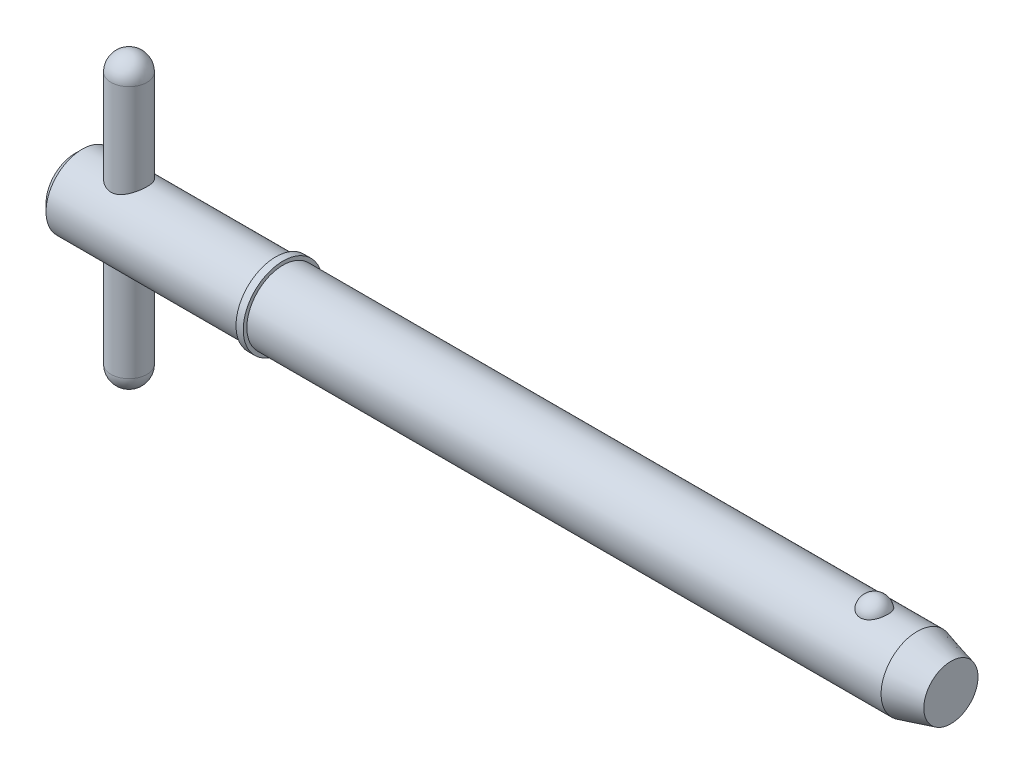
ISO-10303-21;
HEADER;
FILE_DESCRIPTION(('STEP AP214'),'2;1');
FILE_NAME('part.step','',(''),(''),'','','');
FILE_SCHEMA(('AUTOMOTIVE_DESIGN { 1 0 10303 214 1 1 1 1 }'));
ENDSEC;
DATA;
#1=APPLICATION_CONTEXT('core data for automotive mechanical design processes');
#2=APPLICATION_PROTOCOL_DEFINITION('international standard','automotive_design',2000,#1);
#3=PRODUCT_CONTEXT('',#1,'mechanical');
#4=PRODUCT('Part','Part','',(#3));
#5=PRODUCT_RELATED_PRODUCT_CATEGORY('part','',(#4));
#6=PRODUCT_DEFINITION_FORMATION('','',#4);
#7=PRODUCT_DEFINITION_CONTEXT('part definition',#1,'design');
#8=PRODUCT_DEFINITION('design','',#6,#7);
#9=PRODUCT_DEFINITION_SHAPE('','',#8);
#10=(LENGTH_UNIT() NAMED_UNIT(*) SI_UNIT(.MILLI.,.METRE.));
#11=(NAMED_UNIT(*) PLANE_ANGLE_UNIT() SI_UNIT($,.RADIAN.));
#12=(NAMED_UNIT(*) SI_UNIT($,.STERADIAN.) SOLID_ANGLE_UNIT());
#13=UNCERTAINTY_MEASURE_WITH_UNIT(LENGTH_MEASURE(1.E-05),#10,'distance_accuracy_value','');
#14=(GEOMETRIC_REPRESENTATION_CONTEXT(3) GLOBAL_UNCERTAINTY_ASSIGNED_CONTEXT((#13)) GLOBAL_UNIT_ASSIGNED_CONTEXT((#10,
#11,#12)) REPRESENTATION_CONTEXT('',''));
#15=CARTESIAN_POINT('',(0.,0.,0.));
#16=DIRECTION('',(0.,0.,1.));
#17=DIRECTION('',(1.,0.,0.));
#18=AXIS2_PLACEMENT_3D('',#15,#16,#17);
#19=CARTESIAN_POINT('',(4.755,12.7,0.));
#20=DIRECTION('',(0.,-1.,0.));
#21=DIRECTION('',(0.,0.,-1.));
#22=AXIS2_PLACEMENT_3D('',#19,#20,#21);
#23=CYLINDRICAL_SURFACE('',#22,1.585);
#24=CARTESIAN_POINT('',(4.755,-11.115,0.));
#25=DIRECTION('',(0.,-1.,0.));
#26=DIRECTION('',(0.,0.,-1.));
#27=AXIS2_PLACEMENT_3D('',#24,#25,#26);
#28=CIRCLE('',#27,1.585);
#29=CARTESIAN_POINT('',(4.755,-11.115,-1.585));
#30=VERTEX_POINT('',#29);
#31=EDGE_CURVE('P0_E10',#30,#30,#28,.F.);
#32=ORIENTED_EDGE('',*,*,#31,.T.);
#33=EDGE_LOOP('',(#32));
#34=FACE_BOUND('',#33,.T.);
#35=CARTESIAN_POINT('',(4.755,11.115,0.));
#36=DIRECTION('',(0.,-1.,0.));
#37=DIRECTION('',(0.,0.,-1.));
#38=AXIS2_PLACEMENT_3D('',#35,#36,#37);
#39=CIRCLE('',#38,1.585);
#40=CARTESIAN_POINT('',(4.755,11.115,-1.585));
#41=VERTEX_POINT('',#40);
#42=EDGE_CURVE('P0_E21',#41,#41,#39,.T.);
#43=ORIENTED_EDGE('',*,*,#42,.T.);
#44=EDGE_LOOP('',(#43));
#45=FACE_BOUND('',#44,.T.);
#46=ADVANCED_FACE('P0_F14',(#34,#45),#23,.T.);
#47=CARTESIAN_POINT('',(4.755,-11.115,0.));
#48=DIRECTION('',(0.,0.,1.));
#49=DIRECTION('',(1.,0.,0.));
#50=AXIS2_PLACEMENT_3D('',#47,#48,#49);
#51=SPHERICAL_SURFACE('',#50,1.585);
#52=CARTESIAN_POINT('',(4.755,-11.115,0.));
#53=DIRECTION('',(0.,-1.,0.));
#54=DIRECTION('',(0.,0.,-1.));
#55=AXIS2_PLACEMENT_3D('',#52,#53,#54);
#56=SPHERICAL_SURFACE('',#55,1.585);
#57=ORIENTED_EDGE('',*,*,#31,.F.);
#58=EDGE_LOOP('',(#57));
#59=FACE_BOUND('',#58,.T.);
#60=ADVANCED_FACE('P0_F29',(#59),#56,.T.);
#61=CARTESIAN_POINT('',(4.755,11.115,0.));
#62=DIRECTION('',(0.,0.,1.));
#63=DIRECTION('',(1.,0.,0.));
#64=AXIS2_PLACEMENT_3D('',#61,#62,#63);
#65=SPHERICAL_SURFACE('',#64,1.585);
#66=CARTESIAN_POINT('',(4.755,11.115,0.));
#67=DIRECTION('',(0.,-1.,0.));
#68=DIRECTION('',(0.,0.,-1.));
#69=AXIS2_PLACEMENT_3D('',#66,#67,#68);
#70=SPHERICAL_SURFACE('',#69,1.585);
#71=ORIENTED_EDGE('',*,*,#42,.F.);
#72=EDGE_LOOP('',(#71));
#73=FACE_BOUND('',#72,.T.);
#74=ADVANCED_FACE('P0_F16',(#73),#70,.T.);
#75=CLOSED_SHELL('',(#46,#60,#74));
#76=MANIFOLD_SOLID_BREP('P0_B1',#75);
#77=CARTESIAN_POINT('',(0.,0.,0.));
#78=DIRECTION('',(1.,0.,0.));
#79=DIRECTION('',(0.,0.,-1.));
#80=AXIS2_PLACEMENT_3D('',#77,#78,#79);
#81=CYLINDRICAL_SURFACE('',#80,3.175);
#82=CARTESIAN_POINT('',(74.0476846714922,0.,0.));
#83=DIRECTION('',(1.,0.,0.));
#84=DIRECTION('',(0.,0.,-1.));
#85=AXIS2_PLACEMENT_3D('',#82,#83,#84);
#86=CIRCLE('',#85,3.175);
#87=CARTESIAN_POINT('',(74.0476846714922,0.,-3.175));
#88=VERTEX_POINT('',#87);
#89=EDGE_CURVE('P1_E81',#88,#88,#86,.T.);
#90=ORIENTED_EDGE('',*,*,#89,.F.);
#91=EDGE_LOOP('',(#90));
#92=FACE_BOUND('',#91,.T.);
#93=CARTESIAN_POINT('',(18.29,0.,0.));
#94=DIRECTION('',(1.,0.,0.));
#95=DIRECTION('',(0.,0.,-1.));
#96=AXIS2_PLACEMENT_3D('',#93,#94,#95);
#97=CIRCLE('',#96,3.175);
#98=CARTESIAN_POINT('',(18.29,0.,-3.175));
#99=VERTEX_POINT('',#98);
#100=EDGE_CURVE('P1_E85',#99,#99,#97,.T.);
#101=ORIENTED_EDGE('',*,*,#100,.T.);
#102=EDGE_LOOP('',(#101));
#103=FACE_BOUND('',#102,.T.);
#104=CARTESIAN_POINT('',(70.2757276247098,2.92898950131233,1.2254164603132));
#105=CARTESIAN_POINT('',(70.212316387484,2.92899434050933,1.22541146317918));
#106=CARTESIAN_POINT('',(70.1487979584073,2.93112688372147,1.2203464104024));
#107=CARTESIAN_POINT('',(70.0235306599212,2.93942752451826,1.20020949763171));
#108=CARTESIAN_POINT('',(69.9617869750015,2.9456063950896,1.1851109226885));
#109=CARTESIAN_POINT('',(69.8420651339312,2.96127115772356,1.14540352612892));
#110=CARTESIAN_POINT('',(69.7840775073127,2.97074831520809,1.12081980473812));
#111=CARTESIAN_POINT('',(69.6731943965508,2.99197584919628,1.06285154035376));
#112=CARTESIAN_POINT('',(69.6202966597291,3.0037252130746,1.02947091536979));
#113=CARTESIAN_POINT('',(69.5192688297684,3.02865714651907,0.953674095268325));
#114=CARTESIAN_POINT('',(69.471324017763,3.04187163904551,0.911021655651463));
#115=CARTESIAN_POINT('',(69.3830360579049,3.06808741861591,0.818400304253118));
#116=CARTESIAN_POINT('',(69.3426952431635,3.08108863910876,0.768429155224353));
#117=CARTESIAN_POINT('',(69.2688039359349,3.10614903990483,0.660064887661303));
#118=CARTESIAN_POINT('',(69.2356330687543,3.11814104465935,0.601396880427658));
#119=CARTESIAN_POINT('',(69.1791190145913,3.13926931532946,0.479026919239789));
#120=CARTESIAN_POINT('',(69.1557764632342,3.14840539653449,0.415324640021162));
#121=CARTESIAN_POINT('',(69.1191785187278,3.16298160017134,0.283885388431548));
#122=CARTESIAN_POINT('',(69.1060407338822,3.16837855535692,0.216110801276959));
#123=CARTESIAN_POINT('',(69.0905676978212,3.17475386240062,0.0791367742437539));
#124=CARTESIAN_POINT('',(69.088232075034,3.17573236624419,0.00993738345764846));
#125=CARTESIAN_POINT('',(69.094388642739,3.17318075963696,-0.127420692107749));
#126=CARTESIAN_POINT('',(69.1028073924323,3.16968122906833,-0.19558325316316));
#127=CARTESIAN_POINT('',(69.1301752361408,3.1585790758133,-0.329413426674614));
#128=CARTESIAN_POINT('',(69.1491245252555,3.15097637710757,-0.395080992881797));
#129=CARTESIAN_POINT('',(69.1972057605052,3.13242485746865,-0.5221806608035));
#130=CARTESIAN_POINT('',(69.2263524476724,3.12147119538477,-0.583606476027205));
#131=CARTESIAN_POINT('',(69.2942352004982,3.09734973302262,-0.700436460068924));
#132=CARTESIAN_POINT('',(69.332972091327,3.08418174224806,-0.755840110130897));
#133=CARTESIAN_POINT('',(69.4194771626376,3.05694884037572,-0.859404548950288));
#134=CARTESIAN_POINT('',(69.4672961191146,3.04287919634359,-0.907521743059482));
#135=CARTESIAN_POINT('',(69.5707353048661,3.01548927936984,-0.994758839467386));
#136=CARTESIAN_POINT('',(69.6263549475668,3.0021689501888,-1.03387941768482));
#137=CARTESIAN_POINT('',(69.7428093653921,2.97810316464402,-1.10126594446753));
#138=CARTESIAN_POINT('',(69.8035182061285,2.96731170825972,-1.12973256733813));
#139=CARTESIAN_POINT('',(69.9293712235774,2.94928934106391,-1.17598467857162));
#140=CARTESIAN_POINT('',(69.9945137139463,2.94205708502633,-1.19377420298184));
#141=CARTESIAN_POINT('',(70.1238562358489,2.93233065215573,-1.21746387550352));
#142=CARTESIAN_POINT('',(70.1879385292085,2.92961621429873,-1.22391763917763));
#143=CARTESIAN_POINT('',(70.3163375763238,2.92855752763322,-1.22644976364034));
#144=CARTESIAN_POINT('',(70.3806542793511,2.93021238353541,-1.22253024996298));
#145=CARTESIAN_POINT('',(70.5055239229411,2.9375685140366,-1.20474140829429));
#146=CARTESIAN_POINT('',(70.566131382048,2.94313790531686,-1.19119621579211));
#147=CARTESIAN_POINT('',(70.6841106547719,2.95756226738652,-1.15491492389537));
#148=CARTESIAN_POINT('',(70.7414822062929,2.96641750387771,-1.13217808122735));
#149=CARTESIAN_POINT('',(70.8527699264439,2.98669918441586,-1.07755083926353));
#150=CARTESIAN_POINT('',(70.9065845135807,2.9981771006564,-1.04547308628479));
#151=CARTESIAN_POINT('',(71.0081473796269,3.02240235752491,-0.973220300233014));
#152=CARTESIAN_POINT('',(71.0558942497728,3.03514999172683,-0.933043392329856));
#153=CARTESIAN_POINT('',(71.1465817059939,3.06131230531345,-0.843372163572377));
#154=CARTESIAN_POINT('',(71.1891588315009,3.07472822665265,-0.793510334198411));
#155=CARTESIAN_POINT('',(71.2656765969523,3.10021106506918,-0.687241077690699));
#156=CARTESIAN_POINT('',(71.2996156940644,3.1122777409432,-0.630832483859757));
#157=CARTESIAN_POINT('',(71.3591209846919,3.134208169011,-0.51105938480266));
#158=CARTESIAN_POINT('',(71.3843892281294,3.14399040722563,-0.447531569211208));
#159=CARTESIAN_POINT('',(71.4245117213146,3.15983820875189,-0.31682749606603));
#160=CARTESIAN_POINT('',(71.4393659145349,3.16590375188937,-0.249651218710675));
#161=CARTESIAN_POINT('',(71.458358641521,3.17370076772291,-0.113549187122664));
#162=CARTESIAN_POINT('',(71.4624966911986,3.17543204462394,-0.0446233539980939));
#163=CARTESIAN_POINT('',(71.4599697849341,3.17438372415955,0.0929938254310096));
#164=CARTESIAN_POINT('',(71.4533050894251,3.17160423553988,0.16168517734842));
#165=CARTESIAN_POINT('',(71.4293754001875,3.1618438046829,0.296502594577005));
#166=CARTESIAN_POINT('',(71.4121674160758,3.15488546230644,0.362640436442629));
#167=CARTESIAN_POINT('',(71.367547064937,3.13748892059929,0.490896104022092));
#168=CARTESIAN_POINT('',(71.3401339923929,3.12705048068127,0.553013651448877));
#169=CARTESIAN_POINT('',(71.2754626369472,3.10369139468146,0.671876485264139));
#170=CARTESIAN_POINT('',(71.2381467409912,3.0907563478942,0.72858760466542));
#171=CARTESIAN_POINT('',(71.1545246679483,3.06381731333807,0.834653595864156));
#172=CARTESIAN_POINT('',(71.1082189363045,3.04981337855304,0.884008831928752));
#173=CARTESIAN_POINT('',(71.007718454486,3.02230423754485,0.973916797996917));
#174=CARTESIAN_POINT('',(70.953535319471,3.00879833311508,1.01448227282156));
#175=CARTESIAN_POINT('',(70.8385299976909,2.98383625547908,1.0857155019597));
#176=CARTESIAN_POINT('',(70.7777053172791,2.9723808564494,1.11637952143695));
#177=CARTESIAN_POINT('',(70.6533690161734,2.95329063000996,1.16592590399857));
#178=CARTESIAN_POINT('',(70.5900230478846,2.9455373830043,1.18517901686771));
#179=CARTESIAN_POINT('',(70.4607664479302,2.9342556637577,1.21284802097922));
#180=CARTESIAN_POINT('',(70.3948641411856,2.93071450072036,1.2212964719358));
#181=CARTESIAN_POINT('',(70.311116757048,2.9291525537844,1.22502505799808));
#182=CARTESIAN_POINT('',(70.2934263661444,2.92898815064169,1.22541785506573));
#183=CARTESIAN_POINT('',(70.2757276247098,2.92898950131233,1.2254164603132));
#184=B_SPLINE_CURVE_WITH_KNOTS('',3,(#104,#105,#106,#107,#108,#109,#110,#111,#112,#113,#114,
#115,#116,#117,#118,#119,#120,#121,#122,#123,#124,#125,#126,#127,#128,#129,#130,#131,#132,#133,
#134,#135,#136,#137,#138,#139,#140,#141,#142,#143,#144,#145,#146,#147,#148,#149,#150,#151,#152,
#153,#154,#155,#156,#157,#158,#159,#160,#161,#162,#163,#164,#165,#166,#167,#168,#169,#170,#171,
#172,#173,#174,#175,#176,#177,#178,#179,#180,#181,#182,#183),.UNSPECIFIED.,.T.,.F.,(4,2,2,2,2,2,
2,2,2,2,2,2,2,2,2,2,2,2,2,2,2,2,2,2,2,2,2,2,2,2,2,2,2,2,2,2,2,2,2,4),(0.,0.190186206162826,
0.380880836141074,0.571074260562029,0.761183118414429,0.956866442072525,1.15260970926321,
1.3570177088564,1.56143892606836,1.76818248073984,1.97491892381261,2.18025109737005,
2.38558707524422,2.59122111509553,2.79687285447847,3.00371012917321,3.2105318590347,
3.41323429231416,3.61586005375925,3.80828192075,4.00066436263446,4.18685798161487,
4.37306665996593,4.56330302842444,4.75358348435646,4.95345287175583,5.15335793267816,
5.35957003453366,5.56578325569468,5.7720057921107,5.97822335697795,6.18333558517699,
6.38846199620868,6.59480900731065,6.80114579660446,7.00718137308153,7.21329457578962,
7.41228022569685,7.61066481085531,7.66374777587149),.UNSPECIFIED.);
#185=CARTESIAN_POINT('',(70.2757276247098,2.92898950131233,1.2254164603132));
#186=VERTEX_POINT('',#185);
#187=EDGE_CURVE('P1_E35',#186,#186,#184,.T.);
#188=ORIENTED_EDGE('',*,*,#187,.T.);
#189=EDGE_LOOP('',(#188));
#190=FACE_BOUND('',#189,.T.);
#191=ADVANCED_FACE('P1_F13',(#92,#103,#190),#81,.T.);
#192=CARTESIAN_POINT('',(0.,0.,0.));
#193=DIRECTION('',(-1.,0.,0.));
#194=DIRECTION('',(0.,0.,1.));
#195=AXIS2_PLACEMENT_3D('',#192,#193,#194);
#196=PLANE('',#195);
#197=CARTESIAN_POINT('',(0.,0.,0.));
#198=DIRECTION('',(1.,0.,0.));
#199=DIRECTION('',(0.,0.,-1.));
#200=AXIS2_PLACEMENT_3D('',#197,#198,#199);
#201=CIRCLE('',#200,2.54);
#202=CARTESIAN_POINT('',(0.,0.,-2.54));
#203=VERTEX_POINT('',#202);
#204=EDGE_CURVE('P1_E9',#203,#203,#201,.T.);
#205=ORIENTED_EDGE('',*,*,#204,.F.);
#206=EDGE_LOOP('',(#205));
#207=FACE_BOUND('',#206,.T.);
#208=ADVANCED_FACE('P1_F15',(#207),#196,.T.);
#209=CARTESIAN_POINT('',(0.634999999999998,0.,0.));
#210=DIRECTION('',(1.,0.,0.));
#211=DIRECTION('',(0.,0.,-1.));
#212=AXIS2_PLACEMENT_3D('',#209,#210,#211);
#213=CONICAL_SURFACE('',#212,3.175,0.78539816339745);
#214=ORIENTED_EDGE('',*,*,#204,.T.);
#215=EDGE_LOOP('',(#214));
#216=FACE_BOUND('',#215,.T.);
#217=CARTESIAN_POINT('',(0.634999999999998,0.,0.));
#218=DIRECTION('',(1.,0.,0.));
#219=DIRECTION('',(0.,0.,-1.));
#220=AXIS2_PLACEMENT_3D('',#217,#218,#219);
#221=CIRCLE('',#220,3.175);
#222=CARTESIAN_POINT('',(0.634999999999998,0.,-3.175));
#223=VERTEX_POINT('',#222);
#224=EDGE_CURVE('P1_E26',#223,#223,#221,.T.);
#225=ORIENTED_EDGE('',*,*,#224,.F.);
#226=EDGE_LOOP('',(#225));
#227=FACE_BOUND('',#226,.T.);
#228=ADVANCED_FACE('P1_F77',(#216,#227),#213,.T.);
#229=CARTESIAN_POINT('',(0.,0.,0.));
#230=DIRECTION('',(1.,0.,0.));
#231=DIRECTION('',(0.,0.,-1.));
#232=AXIS2_PLACEMENT_3D('',#229,#230,#231);
#233=CYLINDRICAL_SURFACE('',#232,3.175);
#234=CARTESIAN_POINT('',(4.755,-2.75107251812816,1.585));
#235=CARTESIAN_POINT('',(4.67238891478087,-2.7510796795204,1.58499425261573));
#236=CARTESIAN_POINT('',(4.58967306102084,-2.75485010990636,1.57849830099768));
#237=CARTESIAN_POINT('',(4.42677850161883,-2.76938647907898,1.55284486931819));
#238=CARTESIAN_POINT('',(4.34660551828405,-2.78016716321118,1.53366069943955));
#239=CARTESIAN_POINT('',(4.19146029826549,-2.80716278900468,1.48366329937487));
#240=CARTESIAN_POINT('',(4.11646293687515,-2.8233488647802,1.45291173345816));
#241=CARTESIAN_POINT('',(3.97271079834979,-2.85928672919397,1.38084067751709));
#242=CARTESIAN_POINT('',(3.90395634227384,-2.87903870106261,1.33952064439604));
#243=CARTESIAN_POINT('',(3.76839976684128,-2.921867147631,1.24350234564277));
#244=CARTESIAN_POINT('',(3.702222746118,-2.94508343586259,1.18798355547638));
#245=CARTESIAN_POINT('',(3.5796334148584,-2.99109588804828,1.06685014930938));
#246=CARTESIAN_POINT('',(3.52322596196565,-3.01389183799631,1.00123054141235));
#247=CARTESIAN_POINT('',(3.41807024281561,-3.05832598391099,0.856373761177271));
#248=CARTESIAN_POINT('',(3.37009053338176,-3.07978367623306,0.776518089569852));
#249=CARTESIAN_POINT('',(3.28853137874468,-3.11730894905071,0.608596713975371));
#250=CARTESIAN_POINT('',(3.25494287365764,-3.1333799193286,0.520536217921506));
#251=CARTESIAN_POINT('',(3.20559401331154,-3.15731341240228,0.345327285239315));
#252=CARTESIAN_POINT('',(3.18873760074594,-3.16567752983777,0.258557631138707));
#253=CARTESIAN_POINT('',(3.16972238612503,-3.17512718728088,0.0830496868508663));
#254=CARTESIAN_POINT('',(3.16755472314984,-3.17621711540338,-0.00568738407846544));
#255=CARTESIAN_POINT('',(3.1775542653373,-3.17123385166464,-0.174372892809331));
#256=CARTESIAN_POINT('',(3.18849502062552,-3.16577346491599,-0.254416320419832));
#257=CARTESIAN_POINT('',(3.22220680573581,-3.14922844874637,-0.411354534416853));
#258=CARTESIAN_POINT('',(3.2449787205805,-3.13814339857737,-0.488249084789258));
#259=CARTESIAN_POINT('',(3.30185558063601,-3.111172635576,-0.638050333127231));
#260=CARTESIAN_POINT('',(3.33611332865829,-3.09522247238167,-0.710886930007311));
#261=CARTESIAN_POINT('',(3.41477890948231,-3.05996035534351,-0.849953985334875));
#262=CARTESIAN_POINT('',(3.45919037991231,-3.04064719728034,-0.916182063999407));
#263=CARTESIAN_POINT('',(3.5617148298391,-2.99832415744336,-1.04681642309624));
#264=CARTESIAN_POINT('',(3.62072497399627,-2.97513741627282,-1.11046186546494));
#265=CARTESIAN_POINT('',(3.7483697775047,-2.92885066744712,-1.22736291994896));
#266=CARTESIAN_POINT('',(3.81701173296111,-2.90575073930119,-1.2806105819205));
#267=CARTESIAN_POINT('',(3.96727993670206,-2.86067370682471,-1.37849835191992));
#268=CARTESIAN_POINT('',(4.04945242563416,-2.83885964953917,-1.42238246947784));
#269=CARTESIAN_POINT('',(4.2213558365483,-2.80110454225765,-1.49537418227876));
#270=CARTESIAN_POINT('',(4.3110787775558,-2.78515738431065,-1.52449715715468));
#271=CARTESIAN_POINT('',(4.48806324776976,-2.76271292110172,-1.56478065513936));
#272=CARTESIAN_POINT('',(4.57495732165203,-2.75556745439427,-1.57718067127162));
#273=CARTESIAN_POINT('',(4.74985771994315,-2.74969306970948,-1.58740564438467));
#274=CARTESIAN_POINT('',(4.8378632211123,-2.75095824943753,-1.58524082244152));
#275=CARTESIAN_POINT('',(5.00227282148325,-2.76107477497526,-1.56753530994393));
#276=CARTESIAN_POINT('',(5.07889680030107,-2.76908515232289,-1.55347662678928));
#277=CARTESIAN_POINT('',(5.22855309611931,-2.79054849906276,-1.51458035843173));
#278=CARTESIAN_POINT('',(5.30158424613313,-2.80400322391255,-1.489739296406));
#279=CARTESIAN_POINT('',(5.44583114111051,-2.83556995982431,-1.42877335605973));
#280=CARTESIAN_POINT('',(5.51680600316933,-2.85386886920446,-1.39217900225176));
#281=CARTESIAN_POINT('',(5.6520174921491,-2.89289503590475,-1.30915485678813));
#282=CARTESIAN_POINT('',(5.71625063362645,-2.91362353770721,-1.26272001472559));
#283=CARTESIAN_POINT('',(5.8445938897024,-2.95830220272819,-1.15451693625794));
#284=CARTESIAN_POINT('',(5.90767560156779,-2.98233004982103,-1.09155543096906));
#285=CARTESIAN_POINT('',(6.0226995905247,-3.02864458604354,-0.955560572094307));
#286=CARTESIAN_POINT('',(6.07463814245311,-3.05093069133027,-0.882523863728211));
#287=CARTESIAN_POINT('',(6.16704288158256,-3.09200671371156,-0.725836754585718));
#288=CARTESIAN_POINT('',(6.20717458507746,-3.11069030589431,-0.64195924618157));
#289=CARTESIAN_POINT('',(6.27235859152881,-3.1416474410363,-0.467442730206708));
#290=CARTESIAN_POINT('',(6.29742409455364,-3.15392659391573,-0.376809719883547));
#291=CARTESIAN_POINT('',(6.32960989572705,-3.16979844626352,-0.200314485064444));
#292=CARTESIAN_POINT('',(6.33816324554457,-3.17408359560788,-0.114775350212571));
#293=CARTESIAN_POINT('',(6.34130309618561,-3.17565001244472,0.0566108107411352));
#294=CARTESIAN_POINT('',(6.33589445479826,-3.17293371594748,0.142457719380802));
#295=CARTESIAN_POINT('',(6.31221457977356,-3.16120608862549,0.306097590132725));
#296=CARTESIAN_POINT('',(6.2948097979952,-3.15261910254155,0.38404960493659));
#297=CARTESIAN_POINT('',(6.24879775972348,-3.13040364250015,0.535801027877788));
#298=CARTESIAN_POINT('',(6.22018889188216,-3.11677444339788,0.609599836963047));
#299=CARTESIAN_POINT('',(6.15130303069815,-3.08497808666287,0.754502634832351));
#300=CARTESIAN_POINT('',(6.11057850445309,-3.0666414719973,0.82535556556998));
#301=CARTESIAN_POINT('',(6.01917980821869,-3.02735012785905,0.95951596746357));
#302=CARTESIAN_POINT('',(5.96850106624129,-3.00639419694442,1.02281994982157));
#303=CARTESIAN_POINT('',(5.8528006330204,-2.96149402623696,1.1467073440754));
#304=CARTESIAN_POINT('',(5.78685463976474,-2.93745961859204,1.20639723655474));
#305=CARTESIAN_POINT('',(5.64552278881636,-2.89084502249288,1.31419099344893));
#306=CARTESIAN_POINT('',(5.57012871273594,-2.8682661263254,1.36228466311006));
#307=CARTESIAN_POINT('',(5.40892145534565,-2.82661780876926,1.44677201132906));
#308=CARTESIAN_POINT('',(5.32285703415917,-2.80767948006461,1.48275497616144));
#309=CARTESIAN_POINT('',(5.14469010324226,-2.77716572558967,1.53916557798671));
#310=CARTESIAN_POINT('',(5.05260892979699,-2.76556569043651,1.55964525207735));
#311=CARTESIAN_POINT('',(4.92544162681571,-2.75613775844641,1.57618070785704));
#312=CARTESIAN_POINT('',(4.89147210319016,-2.75424493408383,1.57948285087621));
#313=CARTESIAN_POINT('',(4.82334103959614,-2.75171079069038,1.58389375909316));
#314=CARTESIAN_POINT('',(4.78917948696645,-2.75106955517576,1.58500237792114));
#315=CARTESIAN_POINT('',(4.755,-2.75107251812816,1.585));
#316=B_SPLINE_CURVE_WITH_KNOTS('',3,(#234,#235,#236,#237,#238,#239,#240,#241,#242,#243,#244,
#245,#246,#247,#248,#249,#250,#251,#252,#253,#254,#255,#256,#257,#258,#259,#260,#261,#262,#263,
#264,#265,#266,#267,#268,#269,#270,#271,#272,#273,#274,#275,#276,#277,#278,#279,#280,#281,#282,
#283,#284,#285,#286,#287,#288,#289,#290,#291,#292,#293,#294,#295,#296,#297,#298,#299,#300,#301,
#302,#303,#304,#305,#306,#307,#308,#309,#310,#311,#312,#313,#314,#315),.UNSPECIFIED.,.T.,.F.,(4,
2,2,2,2,2,2,2,2,2,2,2,2,2,2,2,2,2,2,2,2,2,2,2,2,2,2,2,2,2,2,2,2,2,2,2,2,2,2,2,4),(0.,
0.247689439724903,0.495901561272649,0.742808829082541,0.989728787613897,1.25694656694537,
1.52429683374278,1.80959781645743,2.0947189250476,2.35960564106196,2.62433255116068,
2.86610932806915,3.1079041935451,3.35305262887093,3.59828902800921,3.86665310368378,
4.13522157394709,4.4207514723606,4.70598326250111,4.9686344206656,5.23110127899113,
5.46499114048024,5.69895647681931,5.94376186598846,6.1886932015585,6.46438263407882,
6.74016408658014,7.0231370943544,7.30586181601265,7.5626977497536,7.81944433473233,
8.05935987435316,8.29930993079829,8.54954401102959,8.79989329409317,9.07508848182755,
9.35052473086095,9.63453318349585,9.91758407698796,10.0200561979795,10.1225351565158),.UNSPECIFIED.);
#317=CARTESIAN_POINT('',(4.755,-2.75107251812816,1.585));
#318=VERTEX_POINT('',#317);
#319=EDGE_CURVE('P1_E17',#318,#318,#316,.T.);
#320=ORIENTED_EDGE('',*,*,#319,.F.);
#321=EDGE_LOOP('',(#320));
#322=FACE_BOUND('',#321,.T.);
#323=CARTESIAN_POINT('',(4.755,2.75107251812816,1.585));
#324=CARTESIAN_POINT('',(4.83761108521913,2.7510796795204,1.58499425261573));
#325=CARTESIAN_POINT('',(4.92032693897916,2.75485010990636,1.57849830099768));
#326=CARTESIAN_POINT('',(5.08322149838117,2.76938647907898,1.55284486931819));
#327=CARTESIAN_POINT('',(5.16339448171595,2.78016716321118,1.53366069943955));
#328=CARTESIAN_POINT('',(5.31853970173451,2.80716278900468,1.48366329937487));
#329=CARTESIAN_POINT('',(5.39353706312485,2.8233488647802,1.45291173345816));
#330=CARTESIAN_POINT('',(5.53728920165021,2.85928672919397,1.38084067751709));
#331=CARTESIAN_POINT('',(5.60604365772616,2.87903870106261,1.33952064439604));
#332=CARTESIAN_POINT('',(5.74160023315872,2.921867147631,1.24350234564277));
#333=CARTESIAN_POINT('',(5.807777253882,2.94508343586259,1.18798355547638));
#334=CARTESIAN_POINT('',(5.9303665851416,2.99109588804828,1.06685014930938));
#335=CARTESIAN_POINT('',(5.98677403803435,3.01389183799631,1.00123054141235));
#336=CARTESIAN_POINT('',(6.09192975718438,3.05832598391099,0.85637376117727));
#337=CARTESIAN_POINT('',(6.13990946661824,3.07978367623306,0.776518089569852));
#338=CARTESIAN_POINT('',(6.22146862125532,3.11730894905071,0.608596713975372));
#339=CARTESIAN_POINT('',(6.25505712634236,3.1333799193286,0.520536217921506));
#340=CARTESIAN_POINT('',(6.30440598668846,3.15731341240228,0.345327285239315));
#341=CARTESIAN_POINT('',(6.32126239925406,3.16567752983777,0.258557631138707));
#342=CARTESIAN_POINT('',(6.34027761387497,3.17512718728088,0.0830496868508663));
#343=CARTESIAN_POINT('',(6.34244527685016,3.17621711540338,-0.00568738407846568));
#344=CARTESIAN_POINT('',(6.3324457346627,3.17123385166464,-0.174372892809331));
#345=CARTESIAN_POINT('',(6.32150497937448,3.16577346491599,-0.254416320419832));
#346=CARTESIAN_POINT('',(6.28779319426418,3.14922844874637,-0.411354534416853));
#347=CARTESIAN_POINT('',(6.2650212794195,3.13814339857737,-0.488249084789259));
#348=CARTESIAN_POINT('',(6.20814441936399,3.111172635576,-0.638050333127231));
#349=CARTESIAN_POINT('',(6.17388667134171,3.09522247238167,-0.710886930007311));
#350=CARTESIAN_POINT('',(6.09522109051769,3.05996035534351,-0.849953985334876));
#351=CARTESIAN_POINT('',(6.05080962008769,3.04064719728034,-0.916182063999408));
#352=CARTESIAN_POINT('',(5.9482851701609,2.99832415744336,-1.04681642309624));
#353=CARTESIAN_POINT('',(5.88927502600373,2.97513741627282,-1.11046186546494));
#354=CARTESIAN_POINT('',(5.7616302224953,2.92885066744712,-1.22736291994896));
#355=CARTESIAN_POINT('',(5.69298826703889,2.90575073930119,-1.2806105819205));
#356=CARTESIAN_POINT('',(5.54272006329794,2.86067370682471,-1.37849835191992));
#357=CARTESIAN_POINT('',(5.46054757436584,2.83885964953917,-1.42238246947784));
#358=CARTESIAN_POINT('',(5.2886441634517,2.80110454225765,-1.49537418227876));
#359=CARTESIAN_POINT('',(5.19892122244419,2.78515738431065,-1.52449715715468));
#360=CARTESIAN_POINT('',(5.02193675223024,2.76271292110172,-1.56478065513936));
#361=CARTESIAN_POINT('',(4.93504267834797,2.75556745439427,-1.57718067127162));
#362=CARTESIAN_POINT('',(4.76014228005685,2.74969306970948,-1.58740564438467));
#363=CARTESIAN_POINT('',(4.6721367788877,2.75095824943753,-1.58524082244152));
#364=CARTESIAN_POINT('',(4.50772717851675,2.76107477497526,-1.56753530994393));
#365=CARTESIAN_POINT('',(4.43110319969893,2.76908515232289,-1.55347662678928));
#366=CARTESIAN_POINT('',(4.28144690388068,2.79054849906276,-1.51458035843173));
#367=CARTESIAN_POINT('',(4.20841575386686,2.80400322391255,-1.489739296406));
#368=CARTESIAN_POINT('',(4.06416885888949,2.83556995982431,-1.42877335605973));
#369=CARTESIAN_POINT('',(3.99319399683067,2.85386886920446,-1.39217900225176));
#370=CARTESIAN_POINT('',(3.8579825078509,2.89289503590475,-1.30915485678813));
#371=CARTESIAN_POINT('',(3.79374936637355,2.91362353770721,-1.26272001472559));
#372=CARTESIAN_POINT('',(3.6654061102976,2.95830220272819,-1.15451693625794));
#373=CARTESIAN_POINT('',(3.60232439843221,2.98233004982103,-1.09155543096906));
#374=CARTESIAN_POINT('',(3.4873004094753,3.02864458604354,-0.955560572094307));
#375=CARTESIAN_POINT('',(3.43536185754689,3.05093069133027,-0.88252386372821));
#376=CARTESIAN_POINT('',(3.34295711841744,3.09200671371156,-0.725836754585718));
#377=CARTESIAN_POINT('',(3.30282541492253,3.11069030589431,-0.64195924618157));
#378=CARTESIAN_POINT('',(3.23764140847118,3.14164744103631,-0.467442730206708));
#379=CARTESIAN_POINT('',(3.21257590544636,3.15392659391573,-0.376809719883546));
#380=CARTESIAN_POINT('',(3.18039010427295,3.16979844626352,-0.200314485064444));
#381=CARTESIAN_POINT('',(3.17183675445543,3.17408359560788,-0.114775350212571));
#382=CARTESIAN_POINT('',(3.16869690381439,3.17565001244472,0.0566108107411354));
#383=CARTESIAN_POINT('',(3.17410554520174,3.17293371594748,0.142457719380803));
#384=CARTESIAN_POINT('',(3.19778542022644,3.16120608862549,0.306097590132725));
#385=CARTESIAN_POINT('',(3.2151902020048,3.15261910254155,0.384049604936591));
#386=CARTESIAN_POINT('',(3.26120224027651,3.13040364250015,0.535801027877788));
#387=CARTESIAN_POINT('',(3.28981110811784,3.11677444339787,0.609599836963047));
#388=CARTESIAN_POINT('',(3.35869696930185,3.08497808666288,0.754502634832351));
#389=CARTESIAN_POINT('',(3.39942149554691,3.0666414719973,0.82535556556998));
#390=CARTESIAN_POINT('',(3.49082019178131,3.02735012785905,0.95951596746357));
#391=CARTESIAN_POINT('',(3.54149893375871,3.00639419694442,1.02281994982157));
#392=CARTESIAN_POINT('',(3.6571993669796,2.96149402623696,1.1467073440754));
#393=CARTESIAN_POINT('',(3.72314536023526,2.93745961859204,1.20639723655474));
#394=CARTESIAN_POINT('',(3.86447721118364,2.89084502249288,1.31419099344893));
#395=CARTESIAN_POINT('',(3.93987128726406,2.8682661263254,1.36228466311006));
#396=CARTESIAN_POINT('',(4.10107854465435,2.82661780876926,1.44677201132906));
#397=CARTESIAN_POINT('',(4.18714296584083,2.80767948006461,1.48275497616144));
#398=CARTESIAN_POINT('',(4.36530989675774,2.77716572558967,1.53916557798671));
#399=CARTESIAN_POINT('',(4.45739107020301,2.76556569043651,1.55964525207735));
#400=CARTESIAN_POINT('',(4.58455837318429,2.75613775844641,1.57618070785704));
#401=CARTESIAN_POINT('',(4.61852789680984,2.75424493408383,1.57948285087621));
#402=CARTESIAN_POINT('',(4.68665896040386,2.75171079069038,1.58389375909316));
#403=CARTESIAN_POINT('',(4.72082051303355,2.75106955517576,1.58500237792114));
#404=CARTESIAN_POINT('',(4.755,2.75107251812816,1.585));
#405=B_SPLINE_CURVE_WITH_KNOTS('',3,(#323,#324,#325,#326,#327,#328,#329,#330,#331,#332,#333,
#334,#335,#336,#337,#338,#339,#340,#341,#342,#343,#344,#345,#346,#347,#348,#349,#350,#351,#352,
#353,#354,#355,#356,#357,#358,#359,#360,#361,#362,#363,#364,#365,#366,#367,#368,#369,#370,#371,
#372,#373,#374,#375,#376,#377,#378,#379,#380,#381,#382,#383,#384,#385,#386,#387,#388,#389,#390,
#391,#392,#393,#394,#395,#396,#397,#398,#399,#400,#401,#402,#403,#404),.UNSPECIFIED.,.T.,.F.,(4,
2,2,2,2,2,2,2,2,2,2,2,2,2,2,2,2,2,2,2,2,2,2,2,2,2,2,2,2,2,2,2,2,2,2,2,2,2,2,2,4),(0.,
0.247689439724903,0.495901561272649,0.742808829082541,0.989728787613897,1.25694656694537,
1.52429683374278,1.80959781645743,2.0947189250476,2.35960564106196,2.62433255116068,
2.86610932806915,3.1079041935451,3.35305262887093,3.59828902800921,3.86665310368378,
4.13522157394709,4.4207514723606,4.70598326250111,4.9686344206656,5.23110127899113,
5.46499114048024,5.69895647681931,5.94376186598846,6.1886932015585,6.46438263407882,
6.74016408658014,7.0231370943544,7.30586181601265,7.5626977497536,7.81944433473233,
8.05935987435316,8.29930993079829,8.54954401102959,8.79989329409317,9.07508848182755,
9.35052473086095,9.63453318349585,9.91758407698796,10.0200561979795,10.1225351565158),.UNSPECIFIED.);
#406=CARTESIAN_POINT('',(4.755,2.75107251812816,1.585));
#407=VERTEX_POINT('',#406);
#408=EDGE_CURVE('P1_E43',#407,#407,#405,.T.);
#409=ORIENTED_EDGE('',*,*,#408,.F.);
#410=EDGE_LOOP('',(#409));
#411=FACE_BOUND('',#410,.T.);
#412=ORIENTED_EDGE('',*,*,#224,.T.);
#413=EDGE_LOOP('',(#412));
#414=FACE_BOUND('',#413,.T.);
#415=CARTESIAN_POINT('',(17.655,0.,0.));
#416=DIRECTION('',(1.,0.,0.));
#417=DIRECTION('',(0.,0.,-1.));
#418=AXIS2_PLACEMENT_3D('',#415,#416,#417);
#419=CIRCLE('',#418,3.175);
#420=CARTESIAN_POINT('',(17.655,0.,-3.175));
#421=VERTEX_POINT('',#420);
#422=EDGE_CURVE('P1_E31',#421,#421,#419,.T.);
#423=ORIENTED_EDGE('',*,*,#422,.F.);
#424=EDGE_LOOP('',(#423));
#425=FACE_BOUND('',#424,.T.);
#426=ADVANCED_FACE('P1_F103',(#322,#411,#414,#425),#233,.T.);
#427=CARTESIAN_POINT('',(17.655,3.175,0.));
#428=DIRECTION('',(-1.,0.,0.));
#429=DIRECTION('',(0.,0.,1.));
#430=AXIS2_PLACEMENT_3D('',#427,#428,#429);
#431=PLANE('',#430);
#432=ORIENTED_EDGE('',*,*,#422,.T.);
#433=EDGE_LOOP('',(#432));
#434=FACE_BOUND('',#433,.T.);
#435=CARTESIAN_POINT('',(17.655,0.,0.));
#436=DIRECTION('',(1.,0.,0.));
#437=DIRECTION('',(0.,0.,-1.));
#438=AXIS2_PLACEMENT_3D('',#435,#436,#437);
#439=CIRCLE('',#438,3.4925);
#440=CARTESIAN_POINT('',(17.655,0.,-3.4925));
#441=VERTEX_POINT('',#440);
#442=EDGE_CURVE('P1_E91',#441,#441,#439,.T.);
#443=ORIENTED_EDGE('',*,*,#442,.F.);
#444=EDGE_LOOP('',(#443));
#445=FACE_BOUND('',#444,.T.);
#446=ADVANCED_FACE('P1_F100',(#434,#445),#431,.T.);
#447=CARTESIAN_POINT('',(0.,0.,0.));
#448=DIRECTION('',(1.,0.,0.));
#449=DIRECTION('',(0.,0.,-1.));
#450=AXIS2_PLACEMENT_3D('',#447,#448,#449);
#451=CYLINDRICAL_SURFACE('',#450,3.4925);
#452=ORIENTED_EDGE('',*,*,#442,.T.);
#453=EDGE_LOOP('',(#452));
#454=FACE_BOUND('',#453,.T.);
#455=CARTESIAN_POINT('',(18.29,0.,0.));
#456=DIRECTION('',(1.,0.,0.));
#457=DIRECTION('',(0.,0.,-1.));
#458=AXIS2_PLACEMENT_3D('',#455,#456,#457);
#459=CIRCLE('',#458,3.4925);
#460=CARTESIAN_POINT('',(18.29,0.,-3.4925));
#461=VERTEX_POINT('',#460);
#462=EDGE_CURVE('P1_E88',#461,#461,#459,.T.);
#463=ORIENTED_EDGE('',*,*,#462,.F.);
#464=EDGE_LOOP('',(#463));
#465=FACE_BOUND('',#464,.T.);
#466=ADVANCED_FACE('P1_F68',(#454,#465),#451,.T.);
#467=CARTESIAN_POINT('',(18.29,3.4925,0.));
#468=DIRECTION('',(1.,0.,0.));
#469=DIRECTION('',(0.,0.,-1.));
#470=AXIS2_PLACEMENT_3D('',#467,#468,#469);
#471=PLANE('',#470);
#472=ORIENTED_EDGE('',*,*,#462,.T.);
#473=EDGE_LOOP('',(#472));
#474=FACE_BOUND('',#473,.T.);
#475=ORIENTED_EDGE('',*,*,#100,.F.);
#476=EDGE_LOOP('',(#475));
#477=FACE_BOUND('',#476,.T.);
#478=ADVANCED_FACE('P1_F62',(#474,#477),#471,.T.);
#479=CARTESIAN_POINT('',(77.01,0.,0.));
#480=DIRECTION('',(-1.,0.,0.));
#481=DIRECTION('',(0.,0.,1.));
#482=AXIS2_PLACEMENT_3D('',#479,#480,#481);
#483=CONICAL_SURFACE('',#482,2.38125000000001,0.26179938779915);
#484=ORIENTED_EDGE('',*,*,#89,.T.);
#485=EDGE_LOOP('',(#484));
#486=FACE_BOUND('',#485,.T.);
#487=CARTESIAN_POINT('',(77.01,0.,0.));
#488=DIRECTION('',(1.,0.,0.));
#489=DIRECTION('',(0.,0.,-1.));
#490=AXIS2_PLACEMENT_3D('',#487,#488,#489);
#491=CIRCLE('',#490,2.38125000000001);
#492=CARTESIAN_POINT('',(77.01,0.,-2.38125000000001));
#493=VERTEX_POINT('',#492);
#494=EDGE_CURVE('P1_E42',#493,#493,#491,.T.);
#495=ORIENTED_EDGE('',*,*,#494,.F.);
#496=EDGE_LOOP('',(#495));
#497=FACE_BOUND('',#496,.T.);
#498=ADVANCED_FACE('P1_F59',(#486,#497),#483,.T.);
#499=CARTESIAN_POINT('',(77.01,2.38125000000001,0.));
#500=DIRECTION('',(1.,0.,0.));
#501=DIRECTION('',(0.,0.,-1.));
#502=AXIS2_PLACEMENT_3D('',#499,#500,#501);
#503=PLANE('',#502);
#504=ORIENTED_EDGE('',*,*,#494,.T.);
#505=EDGE_LOOP('',(#504));
#506=FACE_BOUND('',#505,.T.);
#507=ADVANCED_FACE('P1_F55',(#506),#503,.T.);
#508=CARTESIAN_POINT('',(70.2757276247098,2.8575,0.));
#509=DIRECTION('',(-1.,0.,0.));
#510=DIRECTION('',(0.,1.,0.));
#511=AXIS2_PLACEMENT_3D('',#508,#509,#510);
#512=SPHERICAL_SURFACE('',#511,1.22750000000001);
#513=ORIENTED_EDGE('',*,*,#187,.F.);
#514=EDGE_LOOP('',(#513));
#515=FACE_BOUND('',#514,.T.);
#516=ADVANCED_FACE('P1_F50',(#515),#512,.T.);
#517=CARTESIAN_POINT('',(4.755,-3.4925,0.));
#518=DIRECTION('',(0.,1.,0.));
#519=DIRECTION('',(0.,0.,1.));
#520=AXIS2_PLACEMENT_3D('',#517,#518,#519);
#521=CYLINDRICAL_SURFACE('',#520,1.585);
#522=ORIENTED_EDGE('',*,*,#319,.T.);
#523=EDGE_LOOP('',(#522));
#524=FACE_BOUND('',#523,.T.);
#525=ORIENTED_EDGE('',*,*,#408,.T.);
#526=EDGE_LOOP('',(#525));
#527=FACE_BOUND('',#526,.T.);
#528=ADVANCED_FACE('P1_F54',(#524,#527),#521,.F.);
#529=CLOSED_SHELL('',(#191,#208,#228,#426,#446,#466,#478,#498,#507,#516,#528));
#530=MANIFOLD_SOLID_BREP('P1_B1',#529);
#531=ADVANCED_BREP_SHAPE_REPRESENTATION('',(#18,#76,#530),#14);
#532=SHAPE_DEFINITION_REPRESENTATION(#9,#531);
ENDSEC;
END-ISO-10303-21;
